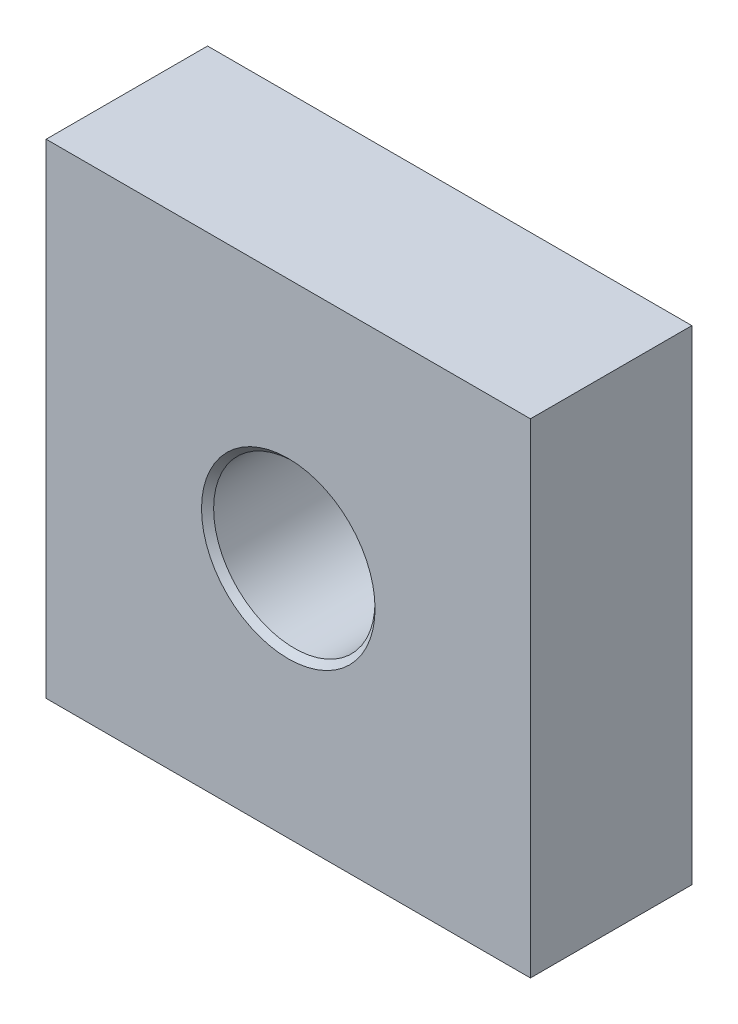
from build123d import *

# Parameters (mm, degrees)
SKETCH1_W          = 120
SKETCH1_H          = 120
SKETCH1_R          = 20
EXTRUDE1_DEPTH     = 20
FRAME_CHAMFER_SIZE = 1.5


with BuildPart() as part:
    # Sketch1 → Extrude1 (new, symmetric)
    with BuildSketch(Plane.XY):
        Rectangle(SKETCH1_W, SKETCH1_H)
        Circle(SKETCH1_R, mode=Mode.SUBTRACT)
    extrude(amount=EXTRUDE1_DEPTH, both=True)

    # Frame Chamfer
    frame_chamfer_edges = [part.edges().sort_by_distance(p)[0] for p in [
        (-20, 0, -20),
        (-20, 0, 20),
    ]]
    chamfer(frame_chamfer_edges, length=FRAME_CHAMFER_SIZE)


solid = part.part
